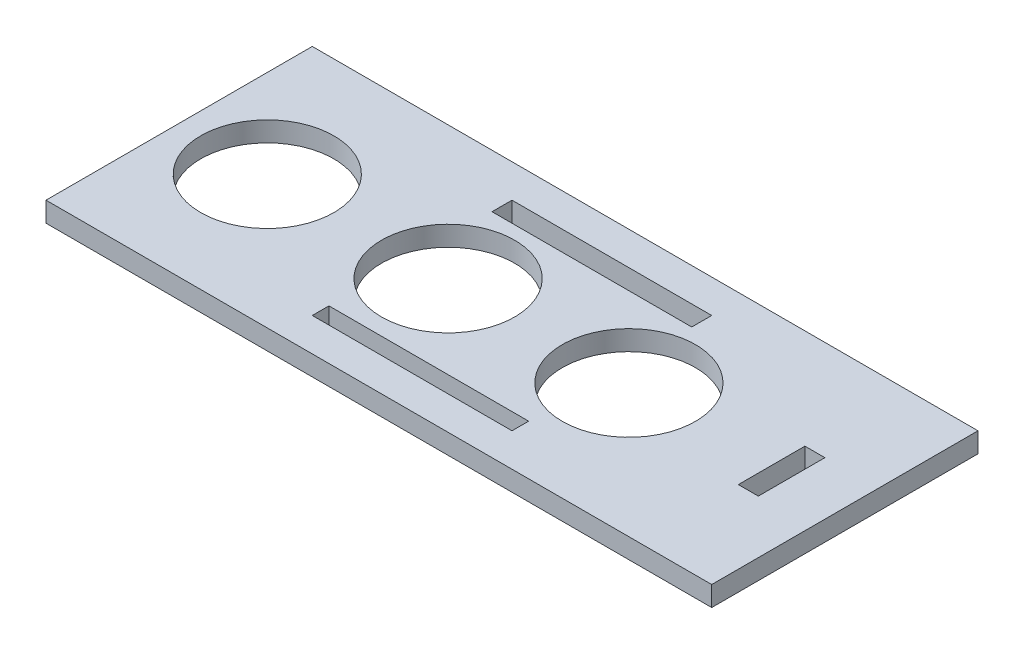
from build123d import *

# Parameters (mm, degrees)
SKETCH1_W           = 100
SKETCH1_H           = 40
SKETCH1_R           = 10
SKETCH1_W_2         = 30
SKETCH1_H_2         = 3
SKETCH1_H_3         = 2.5
SKETCH1_W_3         = 3
SKETCH1_H_4         = 10
BOSS_EXTRUDE1_DEPTH = 3


with BuildPart() as part:
    # Sketch1 → Boss-Extrude1 (new body)
    with BuildSketch(Plane(origin=(0, 0, 0), x_dir=(1, 0, 0), z_dir=(0, 1, 0))):
        Rectangle(SKETCH1_W, SKETCH1_H)
        with Locations(Location((-36.76, 0, 0), (0, 0, 270))):
            Circle(SKETCH1_R, mode=Mode.SUBTRACT)
        with Locations(Location((-9.6, 0, 0), (0, 0, 270))):
            Circle(SKETCH1_R, mode=Mode.SUBTRACT)
        with Locations(Location((17.56, 0, 0), (0, 0, 270))):
            Circle(SKETCH1_R, mode=Mode.SUBTRACT)
        with Locations((0, 13.5)):
            Rectangle(SKETCH1_W_2, SKETCH1_H_2, mode=Mode.SUBTRACT)
        with Locations((0, -13.75)):
            Rectangle(SKETCH1_W_2, SKETCH1_H_3, mode=Mode.SUBTRACT)
        with Locations((40.5, 0)):
            Rectangle(SKETCH1_W_3, SKETCH1_H_4, mode=Mode.SUBTRACT)
    extrude(amount=BOSS_EXTRUDE1_DEPTH)


solid = part.part
